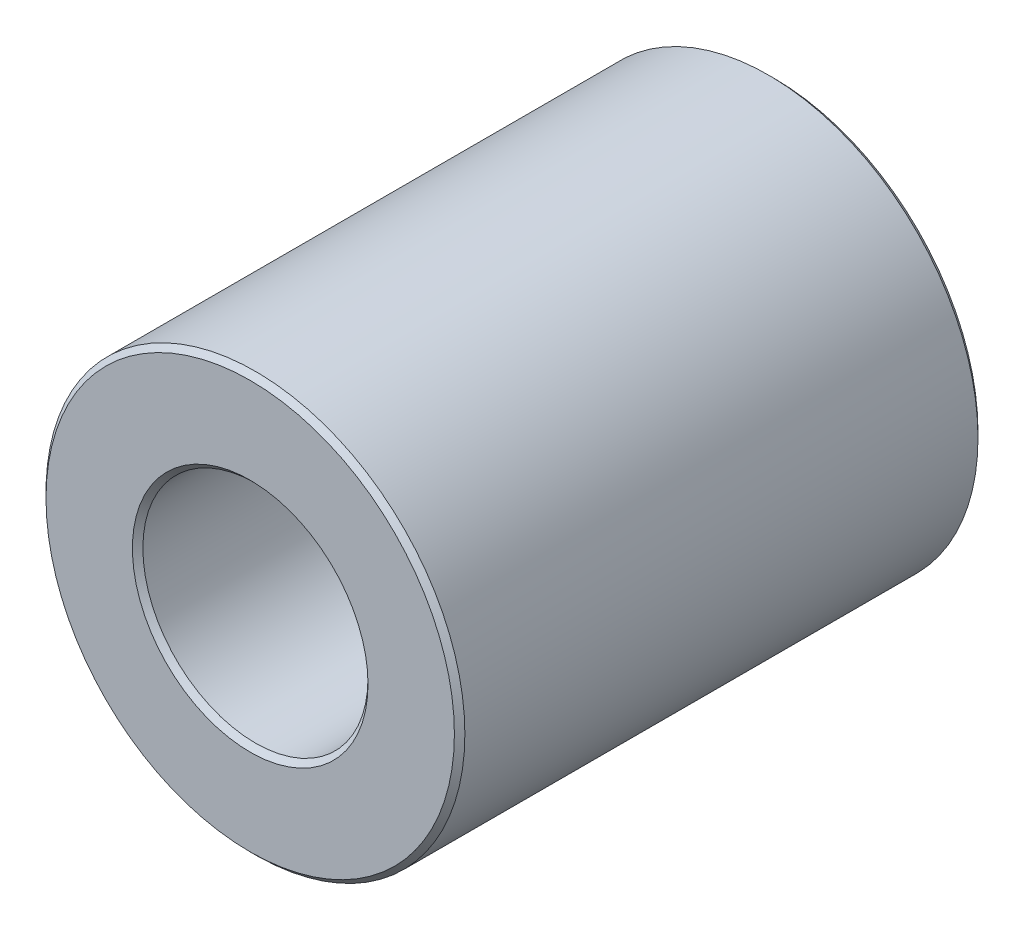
ISO-10303-21;
HEADER;
FILE_DESCRIPTION(('STEP AP214'),'2;1');
FILE_NAME('part.step','',(''),(''),'','','');
FILE_SCHEMA(('AUTOMOTIVE_DESIGN { 1 0 10303 214 1 1 1 1 }'));
ENDSEC;
DATA;
#1=APPLICATION_CONTEXT('core data for automotive mechanical design processes');
#2=APPLICATION_PROTOCOL_DEFINITION('international standard','automotive_design',2000,#1);
#3=PRODUCT_CONTEXT('',#1,'mechanical');
#4=PRODUCT('Part','Part','',(#3));
#5=PRODUCT_RELATED_PRODUCT_CATEGORY('part','',(#4));
#6=PRODUCT_DEFINITION_FORMATION('','',#4);
#7=PRODUCT_DEFINITION_CONTEXT('part definition',#1,'design');
#8=PRODUCT_DEFINITION('design','',#6,#7);
#9=PRODUCT_DEFINITION_SHAPE('','',#8);
#10=(LENGTH_UNIT() NAMED_UNIT(*) SI_UNIT(.MILLI.,.METRE.));
#11=(NAMED_UNIT(*) PLANE_ANGLE_UNIT() SI_UNIT($,.RADIAN.));
#12=(NAMED_UNIT(*) SI_UNIT($,.STERADIAN.) SOLID_ANGLE_UNIT());
#13=UNCERTAINTY_MEASURE_WITH_UNIT(LENGTH_MEASURE(1.E-05),#10,'distance_accuracy_value','');
#14=(GEOMETRIC_REPRESENTATION_CONTEXT(3) GLOBAL_UNCERTAINTY_ASSIGNED_CONTEXT((#13)) GLOBAL_UNIT_ASSIGNED_CONTEXT((#10,
#11,#12)) REPRESENTATION_CONTEXT('',''));
#15=CARTESIAN_POINT('',(0.,0.,0.));
#16=DIRECTION('',(0.,0.,1.));
#17=DIRECTION('',(1.,0.,0.));
#18=AXIS2_PLACEMENT_3D('',#15,#16,#17);
#19=CARTESIAN_POINT('',(0.,0.,5.));
#20=DIRECTION('',(0.,0.,1.));
#21=DIRECTION('',(1.,0.,0.));
#22=AXIS2_PLACEMENT_3D('',#19,#20,#21);
#23=PLANE('',#22);
#24=CARTESIAN_POINT('',(0.,0.,5.));
#25=DIRECTION('',(0.,0.,1.));
#26=DIRECTION('',(1.,0.,0.));
#27=AXIS2_PLACEMENT_3D('',#24,#25,#26);
#28=CIRCLE('',#27,2.25);
#29=CARTESIAN_POINT('',(2.25,0.,5.));
#30=VERTEX_POINT('',#29);
#31=EDGE_CURVE('E10',#30,#30,#28,.F.);
#32=ORIENTED_EDGE('',*,*,#31,.T.);
#33=EDGE_LOOP('',(#32));
#34=FACE_BOUND('',#33,.T.);
#35=CARTESIAN_POINT('',(0.,0.,5.));
#36=DIRECTION('',(0.,0.,1.));
#37=DIRECTION('',(1.,0.,0.));
#38=AXIS2_PLACEMENT_3D('',#35,#36,#37);
#39=CIRCLE('',#38,3.9);
#40=CARTESIAN_POINT('',(3.9,0.,5.));
#41=VERTEX_POINT('',#40);
#42=EDGE_CURVE('E45',#41,#41,#39,.T.);
#43=ORIENTED_EDGE('',*,*,#42,.T.);
#44=EDGE_LOOP('',(#43));
#45=FACE_BOUND('',#44,.T.);
#46=ADVANCED_FACE('F37',(#34,#45),#23,.T.);
#47=CARTESIAN_POINT('',(0.,0.,-5.));
#48=DIRECTION('',(0.,0.,1.));
#49=DIRECTION('',(1.,0.,0.));
#50=AXIS2_PLACEMENT_3D('',#47,#48,#49);
#51=PLANE('',#50);
#52=CARTESIAN_POINT('',(0.,0.,-5.));
#53=DIRECTION('',(0.,0.,1.));
#54=DIRECTION('',(1.,0.,0.));
#55=AXIS2_PLACEMENT_3D('',#52,#53,#54);
#56=CIRCLE('',#55,3.9);
#57=CARTESIAN_POINT('',(3.9,0.,-5.));
#58=VERTEX_POINT('',#57);
#59=EDGE_CURVE('E62',#58,#58,#56,.F.);
#60=ORIENTED_EDGE('',*,*,#59,.T.);
#61=EDGE_LOOP('',(#60));
#62=FACE_BOUND('',#61,.T.);
#63=CARTESIAN_POINT('',(0.,0.,-5.));
#64=DIRECTION('',(0.,0.,1.));
#65=DIRECTION('',(1.,0.,0.));
#66=AXIS2_PLACEMENT_3D('',#63,#64,#65);
#67=CIRCLE('',#66,2.25);
#68=CARTESIAN_POINT('',(2.25,0.,-5.));
#69=VERTEX_POINT('',#68);
#70=EDGE_CURVE('E66',#69,#69,#67,.T.);
#71=ORIENTED_EDGE('',*,*,#70,.T.);
#72=EDGE_LOOP('',(#71));
#73=FACE_BOUND('',#72,.T.);
#74=ADVANCED_FACE('F89',(#62,#73),#51,.F.);
#75=CARTESIAN_POINT('',(0.,0.,5.));
#76=DIRECTION('',(0.,0.,-1.));
#77=DIRECTION('',(-1.,0.,0.));
#78=AXIS2_PLACEMENT_3D('',#75,#76,#77);
#79=CYLINDRICAL_SURFACE('',#78,4.);
#80=CARTESIAN_POINT('',(0.,0.,-4.9));
#81=DIRECTION('',(0.,0.,1.));
#82=DIRECTION('',(1.,0.,0.));
#83=AXIS2_PLACEMENT_3D('',#80,#81,#82);
#84=CIRCLE('',#83,4.);
#85=CARTESIAN_POINT('',(4.,0.,-4.9));
#86=VERTEX_POINT('',#85);
#87=EDGE_CURVE('E69',#86,#86,#84,.T.);
#88=ORIENTED_EDGE('',*,*,#87,.T.);
#89=EDGE_LOOP('',(#88));
#90=FACE_BOUND('',#89,.T.);
#91=CARTESIAN_POINT('',(0.,0.,4.9));
#92=DIRECTION('',(0.,0.,1.));
#93=DIRECTION('',(1.,0.,0.));
#94=AXIS2_PLACEMENT_3D('',#91,#92,#93);
#95=CIRCLE('',#94,4.);
#96=CARTESIAN_POINT('',(4.,0.,4.9));
#97=VERTEX_POINT('',#96);
#98=EDGE_CURVE('E73',#97,#97,#95,.F.);
#99=ORIENTED_EDGE('',*,*,#98,.T.);
#100=EDGE_LOOP('',(#99));
#101=FACE_BOUND('',#100,.T.);
#102=ADVANCED_FACE('F78',(#90,#101),#79,.T.);
#103=CARTESIAN_POINT('',(0.,0.,5.));
#104=DIRECTION('',(0.,0.,-1.));
#105=DIRECTION('',(-1.,0.,0.));
#106=AXIS2_PLACEMENT_3D('',#103,#104,#105);
#107=CYLINDRICAL_SURFACE('',#106,2.15);
#108=CARTESIAN_POINT('',(0.,0.,-4.9));
#109=DIRECTION('',(0.,0.,1.));
#110=DIRECTION('',(1.,0.,0.));
#111=AXIS2_PLACEMENT_3D('',#108,#109,#110);
#112=CIRCLE('',#111,2.15);
#113=CARTESIAN_POINT('',(2.15,0.,-4.9));
#114=VERTEX_POINT('',#113);
#115=EDGE_CURVE('E51',#114,#114,#112,.F.);
#116=ORIENTED_EDGE('',*,*,#115,.T.);
#117=EDGE_LOOP('',(#116));
#118=FACE_BOUND('',#117,.T.);
#119=CARTESIAN_POINT('',(0.,0.,4.9));
#120=DIRECTION('',(0.,0.,1.));
#121=DIRECTION('',(1.,0.,0.));
#122=AXIS2_PLACEMENT_3D('',#119,#120,#121);
#123=CIRCLE('',#122,2.15);
#124=CARTESIAN_POINT('',(2.15,0.,4.9));
#125=VERTEX_POINT('',#124);
#126=EDGE_CURVE('E57',#125,#125,#123,.T.);
#127=ORIENTED_EDGE('',*,*,#126,.T.);
#128=EDGE_LOOP('',(#127));
#129=FACE_BOUND('',#128,.T.);
#130=ADVANCED_FACE('F97',(#118,#129),#107,.F.);
#131=CARTESIAN_POINT('',(0.,0.,-4.9));
#132=DIRECTION('',(0.,0.,1.));
#133=DIRECTION('',(1.,0.,0.));
#134=AXIS2_PLACEMENT_3D('',#131,#132,#133);
#135=CONICAL_SURFACE('',#134,4.,0.785398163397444);
#136=ORIENTED_EDGE('',*,*,#59,.F.);
#137=EDGE_LOOP('',(#136));
#138=FACE_BOUND('',#137,.T.);
#139=ORIENTED_EDGE('',*,*,#87,.F.);
#140=EDGE_LOOP('',(#139));
#141=FACE_BOUND('',#140,.T.);
#142=ADVANCED_FACE('F102',(#138,#141),#135,.T.);
#143=CARTESIAN_POINT('',(0.,0.,-5.));
#144=DIRECTION('',(0.,0.,-1.));
#145=DIRECTION('',(-1.,0.,0.));
#146=AXIS2_PLACEMENT_3D('',#143,#144,#145);
#147=CONICAL_SURFACE('',#146,2.25,0.785398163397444);
#148=ORIENTED_EDGE('',*,*,#115,.F.);
#149=EDGE_LOOP('',(#148));
#150=FACE_BOUND('',#149,.T.);
#151=ORIENTED_EDGE('',*,*,#70,.F.);
#152=EDGE_LOOP('',(#151));
#153=FACE_BOUND('',#152,.T.);
#154=ADVANCED_FACE('F86',(#150,#153),#147,.F.);
#155=CARTESIAN_POINT('',(0.,0.,4.9));
#156=DIRECTION('',(0.,0.,1.));
#157=DIRECTION('',(1.,0.,0.));
#158=AXIS2_PLACEMENT_3D('',#155,#156,#157);
#159=CONICAL_SURFACE('',#158,2.15,0.785398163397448);
#160=ORIENTED_EDGE('',*,*,#31,.F.);
#161=EDGE_LOOP('',(#160));
#162=FACE_BOUND('',#161,.T.);
#163=ORIENTED_EDGE('',*,*,#126,.F.);
#164=EDGE_LOOP('',(#163));
#165=FACE_BOUND('',#164,.T.);
#166=ADVANCED_FACE('F82',(#162,#165),#159,.F.);
#167=CARTESIAN_POINT('',(0.,0.,5.));
#168=DIRECTION('',(0.,0.,-1.));
#169=DIRECTION('',(-1.,0.,0.));
#170=AXIS2_PLACEMENT_3D('',#167,#168,#169);
#171=CONICAL_SURFACE('',#170,3.9,0.78539816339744);
#172=ORIENTED_EDGE('',*,*,#98,.F.);
#173=EDGE_LOOP('',(#172));
#174=FACE_BOUND('',#173,.T.);
#175=ORIENTED_EDGE('',*,*,#42,.F.);
#176=EDGE_LOOP('',(#175));
#177=FACE_BOUND('',#176,.T.);
#178=ADVANCED_FACE('F39',(#174,#177),#171,.T.);
#179=CLOSED_SHELL('',(#46,#74,#102,#130,#142,#154,#166,#178));
#180=MANIFOLD_SOLID_BREP('B2',#179);
#181=ADVANCED_BREP_SHAPE_REPRESENTATION('',(#18,#180),#14);
#182=SHAPE_DEFINITION_REPRESENTATION(#9,#181);
ENDSEC;
END-ISO-10303-21;
